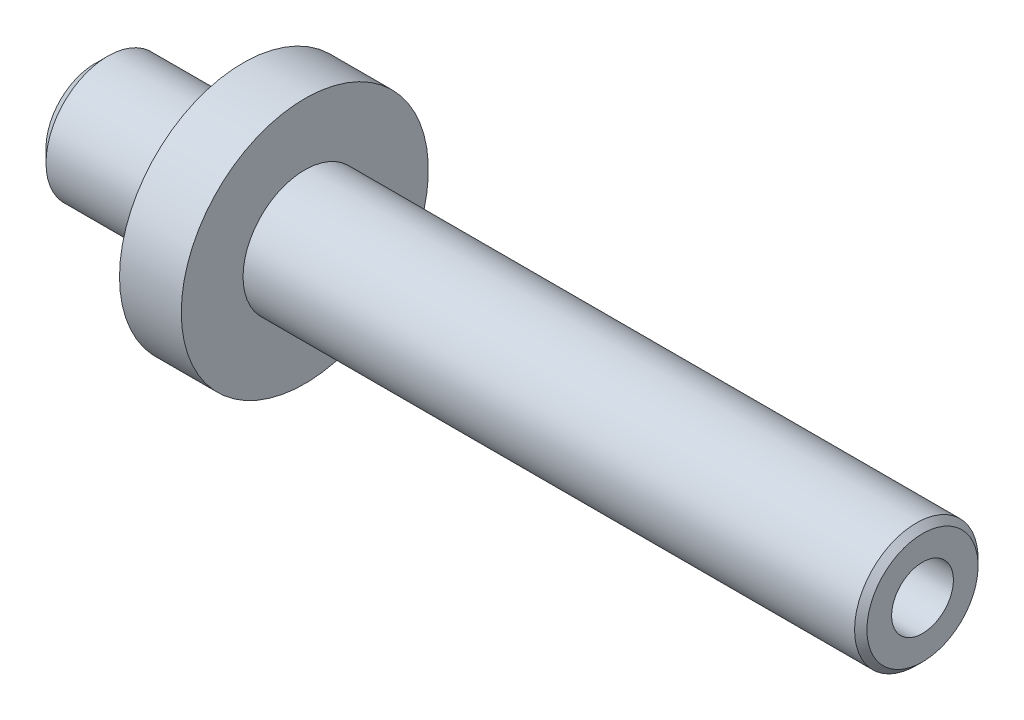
ISO-10303-21;
HEADER;
FILE_DESCRIPTION(('STEP AP214'),'2;1');
FILE_NAME('part.step','',(''),(''),'','','');
FILE_SCHEMA(('AUTOMOTIVE_DESIGN { 1 0 10303 214 1 1 1 1 }'));
ENDSEC;
DATA;
#1=APPLICATION_CONTEXT('core data for automotive mechanical design processes');
#2=APPLICATION_PROTOCOL_DEFINITION('international standard','automotive_design',2000,#1);
#3=PRODUCT_CONTEXT('',#1,'mechanical');
#4=PRODUCT('Part','Part','',(#3));
#5=PRODUCT_RELATED_PRODUCT_CATEGORY('part','',(#4));
#6=PRODUCT_DEFINITION_FORMATION('','',#4);
#7=PRODUCT_DEFINITION_CONTEXT('part definition',#1,'design');
#8=PRODUCT_DEFINITION('design','',#6,#7);
#9=PRODUCT_DEFINITION_SHAPE('','',#8);
#10=(LENGTH_UNIT() NAMED_UNIT(*) SI_UNIT(.MILLI.,.METRE.));
#11=(NAMED_UNIT(*) PLANE_ANGLE_UNIT() SI_UNIT($,.RADIAN.));
#12=(NAMED_UNIT(*) SI_UNIT($,.STERADIAN.) SOLID_ANGLE_UNIT());
#13=UNCERTAINTY_MEASURE_WITH_UNIT(LENGTH_MEASURE(1.E-05),#10,'distance_accuracy_value','');
#14=(GEOMETRIC_REPRESENTATION_CONTEXT(3) GLOBAL_UNCERTAINTY_ASSIGNED_CONTEXT((#13)) GLOBAL_UNIT_ASSIGNED_CONTEXT((#10,
#11,#12)) REPRESENTATION_CONTEXT('',''));
#15=CARTESIAN_POINT('',(0.,0.,0.));
#16=DIRECTION('',(0.,0.,1.));
#17=DIRECTION('',(1.,0.,0.));
#18=AXIS2_PLACEMENT_3D('',#15,#16,#17);
#19=CARTESIAN_POINT('',(-53.3003129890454,0.,0.));
#20=DIRECTION('',(1.,0.,0.));
#21=DIRECTION('',(0.,0.,-1.));
#22=AXIS2_PLACEMENT_3D('',#19,#20,#21);
#23=PLANE('',#22);
#24=CARTESIAN_POINT('',(-53.3003129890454,0.,0.));
#25=DIRECTION('',(1.,0.,0.));
#26=DIRECTION('',(0.,0.,-1.));
#27=AXIS2_PLACEMENT_3D('',#24,#25,#26);
#28=CIRCLE('',#27,3.95);
#29=CARTESIAN_POINT('',(-53.3003129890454,0.,-3.95));
#30=VERTEX_POINT('',#29);
#31=EDGE_CURVE('E73',#30,#30,#28,.F.);
#32=ORIENTED_EDGE('',*,*,#31,.T.);
#33=EDGE_LOOP('',(#32));
#34=FACE_BOUND('',#33,.T.);
#35=ADVANCED_FACE('F38',(#34),#23,.F.);
#36=CARTESIAN_POINT('',(-65.454303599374,0.,0.));
#37=DIRECTION('',(-1.,0.,0.));
#38=DIRECTION('',(0.,0.,1.));
#39=AXIS2_PLACEMENT_3D('',#36,#37,#38);
#40=CYLINDRICAL_SURFACE('',#39,5.);
#41=CARTESIAN_POINT('',(-52.2503129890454,0.,0.));
#42=DIRECTION('',(1.,0.,0.));
#43=DIRECTION('',(0.,0.,-1.));
#44=AXIS2_PLACEMENT_3D('',#41,#42,#43);
#45=CIRCLE('',#44,5.);
#46=CARTESIAN_POINT('',(-52.2503129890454,0.,-5.));
#47=VERTEX_POINT('',#46);
#48=EDGE_CURVE('E76',#47,#47,#45,.T.);
#49=ORIENTED_EDGE('',*,*,#48,.T.);
#50=EDGE_LOOP('',(#49));
#51=FACE_BOUND('',#50,.T.);
#52=CARTESIAN_POINT('',(-41.3003129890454,0.,0.));
#53=DIRECTION('',(-1.,0.,0.));
#54=DIRECTION('',(0.,0.,1.));
#55=AXIS2_PLACEMENT_3D('',#52,#53,#54);
#56=CIRCLE('',#55,5.);
#57=CARTESIAN_POINT('',(-41.3003129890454,0.,5.));
#58=VERTEX_POINT('',#57);
#59=EDGE_CURVE('E70',#58,#58,#56,.T.);
#60=ORIENTED_EDGE('',*,*,#59,.T.);
#61=EDGE_LOOP('',(#60));
#62=FACE_BOUND('',#61,.T.);
#63=ADVANCED_FACE('F99',(#51,#62),#40,.T.);
#64=CARTESIAN_POINT('',(-41.3003129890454,5.,0.));
#65=DIRECTION('',(1.,0.,0.));
#66=DIRECTION('',(0.,0.,-1.));
#67=AXIS2_PLACEMENT_3D('',#64,#65,#66);
#68=PLANE('',#67);
#69=ORIENTED_EDGE('',*,*,#59,.F.);
#70=EDGE_LOOP('',(#69));
#71=FACE_BOUND('',#70,.T.);
#72=CARTESIAN_POINT('',(-41.3003129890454,0.,0.));
#73=DIRECTION('',(-1.,0.,0.));
#74=DIRECTION('',(0.,0.,1.));
#75=AXIS2_PLACEMENT_3D('',#72,#73,#74);
#76=CIRCLE('',#75,10.);
#77=CARTESIAN_POINT('',(-41.3003129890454,0.,10.));
#78=VERTEX_POINT('',#77);
#79=EDGE_CURVE('E67',#78,#78,#76,.T.);
#80=ORIENTED_EDGE('',*,*,#79,.T.);
#81=EDGE_LOOP('',(#80));
#82=FACE_BOUND('',#81,.T.);
#83=ADVANCED_FACE('F104',(#71,#82),#68,.F.);
#84=CARTESIAN_POINT('',(-65.454303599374,0.,0.));
#85=DIRECTION('',(-1.,0.,0.));
#86=DIRECTION('',(0.,0.,1.));
#87=AXIS2_PLACEMENT_3D('',#84,#85,#86);
#88=CYLINDRICAL_SURFACE('',#87,10.);
#89=ORIENTED_EDGE('',*,*,#79,.F.);
#90=EDGE_LOOP('',(#89));
#91=FACE_BOUND('',#90,.T.);
#92=CARTESIAN_POINT('',(-36.3003129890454,0.,0.));
#93=DIRECTION('',(-1.,0.,0.));
#94=DIRECTION('',(0.,0.,1.));
#95=AXIS2_PLACEMENT_3D('',#92,#93,#94);
#96=CIRCLE('',#95,10.);
#97=CARTESIAN_POINT('',(-36.3003129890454,0.,10.));
#98=VERTEX_POINT('',#97);
#99=EDGE_CURVE('E64',#98,#98,#96,.T.);
#100=ORIENTED_EDGE('',*,*,#99,.T.);
#101=EDGE_LOOP('',(#100));
#102=FACE_BOUND('',#101,.T.);
#103=ADVANCED_FACE('F111',(#91,#102),#88,.T.);
#104=CARTESIAN_POINT('',(-36.3003129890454,10.,0.));
#105=DIRECTION('',(-1.,0.,0.));
#106=DIRECTION('',(0.,0.,1.));
#107=AXIS2_PLACEMENT_3D('',#104,#105,#106);
#108=PLANE('',#107);
#109=ORIENTED_EDGE('',*,*,#99,.F.);
#110=EDGE_LOOP('',(#109));
#111=FACE_BOUND('',#110,.T.);
#112=CARTESIAN_POINT('',(-36.3003129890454,0.,0.));
#113=DIRECTION('',(-1.,0.,0.));
#114=DIRECTION('',(0.,0.,1.));
#115=AXIS2_PLACEMENT_3D('',#112,#113,#114);
#116=CIRCLE('',#115,5.);
#117=CARTESIAN_POINT('',(-36.3003129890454,0.,5.));
#118=VERTEX_POINT('',#117);
#119=EDGE_CURVE('E59',#118,#118,#116,.T.);
#120=ORIENTED_EDGE('',*,*,#119,.T.);
#121=EDGE_LOOP('',(#120));
#122=FACE_BOUND('',#121,.T.);
#123=ADVANCED_FACE('F118',(#111,#122),#108,.F.);
#124=CARTESIAN_POINT('',(-65.454303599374,0.,0.));
#125=DIRECTION('',(-1.,0.,0.));
#126=DIRECTION('',(0.,0.,1.));
#127=AXIS2_PLACEMENT_3D('',#124,#125,#126);
#128=CYLINDRICAL_SURFACE('',#127,5.);
#129=CARTESIAN_POINT('',(13.1996870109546,0.,0.));
#130=DIRECTION('',(-1.,0.,0.));
#131=DIRECTION('',(0.,0.,1.));
#132=AXIS2_PLACEMENT_3D('',#129,#130,#131);
#133=CIRCLE('',#132,5.);
#134=CARTESIAN_POINT('',(13.1996870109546,0.,5.));
#135=VERTEX_POINT('',#134);
#136=EDGE_CURVE('E44',#135,#135,#133,.T.);
#137=ORIENTED_EDGE('',*,*,#136,.T.);
#138=EDGE_LOOP('',(#137));
#139=FACE_BOUND('',#138,.T.);
#140=ORIENTED_EDGE('',*,*,#119,.F.);
#141=EDGE_LOOP('',(#140));
#142=FACE_BOUND('',#141,.T.);
#143=ADVANCED_FACE('F81',(#139,#142),#128,.T.);
#144=CARTESIAN_POINT('',(13.6996870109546,5.,0.));
#145=DIRECTION('',(-1.,0.,0.));
#146=DIRECTION('',(0.,0.,1.));
#147=AXIS2_PLACEMENT_3D('',#144,#145,#146);
#148=PLANE('',#147);
#149=CARTESIAN_POINT('',(13.6996870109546,0.,0.));
#150=DIRECTION('',(1.,0.,0.));
#151=DIRECTION('',(0.,0.,-1.));
#152=AXIS2_PLACEMENT_3D('',#149,#150,#151);
#153=CIRCLE('',#152,2.5);
#154=CARTESIAN_POINT('',(13.6996870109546,0.,-2.5));
#155=VERTEX_POINT('',#154);
#156=EDGE_CURVE('E56',#155,#155,#153,.T.);
#157=ORIENTED_EDGE('',*,*,#156,.F.);
#158=EDGE_LOOP('',(#157));
#159=FACE_BOUND('',#158,.T.);
#160=CARTESIAN_POINT('',(13.6996870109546,0.,0.));
#161=DIRECTION('',(-1.,0.,0.));
#162=DIRECTION('',(0.,0.,1.));
#163=AXIS2_PLACEMENT_3D('',#160,#161,#162);
#164=CIRCLE('',#163,4.49999999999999);
#165=CARTESIAN_POINT('',(13.6996870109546,0.,4.49999999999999));
#166=VERTEX_POINT('',#165);
#167=EDGE_CURVE('E11',#166,#166,#164,.F.);
#168=ORIENTED_EDGE('',*,*,#167,.T.);
#169=EDGE_LOOP('',(#168));
#170=FACE_BOUND('',#169,.T.);
#171=ADVANCED_FACE('F94',(#159,#170),#148,.F.);
#172=CARTESIAN_POINT('',(-53.3003129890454,0.,0.));
#173=DIRECTION('',(1.,0.,0.));
#174=DIRECTION('',(0.,0.,-1.));
#175=AXIS2_PLACEMENT_3D('',#172,#173,#174);
#176=CONICAL_SURFACE('',#175,3.95,0.785398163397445);
#177=ORIENTED_EDGE('',*,*,#48,.F.);
#178=EDGE_LOOP('',(#177));
#179=FACE_BOUND('',#178,.T.);
#180=ORIENTED_EDGE('',*,*,#31,.F.);
#181=EDGE_LOOP('',(#180));
#182=FACE_BOUND('',#181,.T.);
#183=ADVANCED_FACE('F86',(#179,#182),#176,.T.);
#184=CARTESIAN_POINT('',(13.1996870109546,0.,0.));
#185=DIRECTION('',(-1.,0.,0.));
#186=DIRECTION('',(0.,0.,1.));
#187=AXIS2_PLACEMENT_3D('',#184,#185,#186);
#188=CONICAL_SURFACE('',#187,5.,0.785398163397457);
#189=ORIENTED_EDGE('',*,*,#167,.F.);
#190=EDGE_LOOP('',(#189));
#191=FACE_BOUND('',#190,.T.);
#192=ORIENTED_EDGE('',*,*,#136,.F.);
#193=EDGE_LOOP('',(#192));
#194=FACE_BOUND('',#193,.T.);
#195=ADVANCED_FACE('F84',(#191,#194),#188,.T.);
#196=CARTESIAN_POINT('',(13.6996870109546,0.,0.));
#197=DIRECTION('',(1.,0.,0.));
#198=DIRECTION('',(0.,0.,-1.));
#199=AXIS2_PLACEMENT_3D('',#196,#197,#198);
#200=CYLINDRICAL_SURFACE('',#199,2.5);
#201=CARTESIAN_POINT('',(-3.30031298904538,0.,0.));
#202=DIRECTION('',(1.,0.,0.));
#203=DIRECTION('',(0.,0.,-1.));
#204=AXIS2_PLACEMENT_3D('',#201,#202,#203);
#205=CIRCLE('',#204,2.5);
#206=CARTESIAN_POINT('',(-3.30031298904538,0.,-2.5));
#207=VERTEX_POINT('',#206);
#208=EDGE_CURVE('E54',#207,#207,#205,.T.);
#209=ORIENTED_EDGE('',*,*,#208,.F.);
#210=EDGE_LOOP('',(#209));
#211=FACE_BOUND('',#210,.T.);
#212=ORIENTED_EDGE('',*,*,#156,.T.);
#213=EDGE_LOOP('',(#212));
#214=FACE_BOUND('',#213,.T.);
#215=ADVANCED_FACE('F50',(#211,#214),#200,.F.);
#216=CARTESIAN_POINT('',(-3.30031298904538,0.,0.));
#217=DIRECTION('',(1.,0.,0.));
#218=DIRECTION('',(0.,0.,-1.));
#219=AXIS2_PLACEMENT_3D('',#216,#217,#218);
#220=CONICAL_SURFACE('',#219,2.5,1.02974425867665);
#221=CARTESIAN_POINT('',(-4.80246453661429,0.,0.));
#222=VERTEX_POINT('',#221);
#223=VERTEX_LOOP('',#222);
#224=FACE_BOUND('',#223,.T.);
#225=ORIENTED_EDGE('',*,*,#208,.T.);
#226=EDGE_LOOP('',(#225));
#227=FACE_BOUND('',#226,.T.);
#228=ADVANCED_FACE('F47',(#224,#227),#220,.F.);
#229=CLOSED_SHELL('',(#35,#63,#83,#103,#123,#143,#171,#183,#195,#215,#228));
#230=MANIFOLD_SOLID_BREP('B2',#229);
#231=ADVANCED_BREP_SHAPE_REPRESENTATION('',(#18,#230),#14);
#232=SHAPE_DEFINITION_REPRESENTATION(#9,#231);
ENDSEC;
END-ISO-10303-21;
